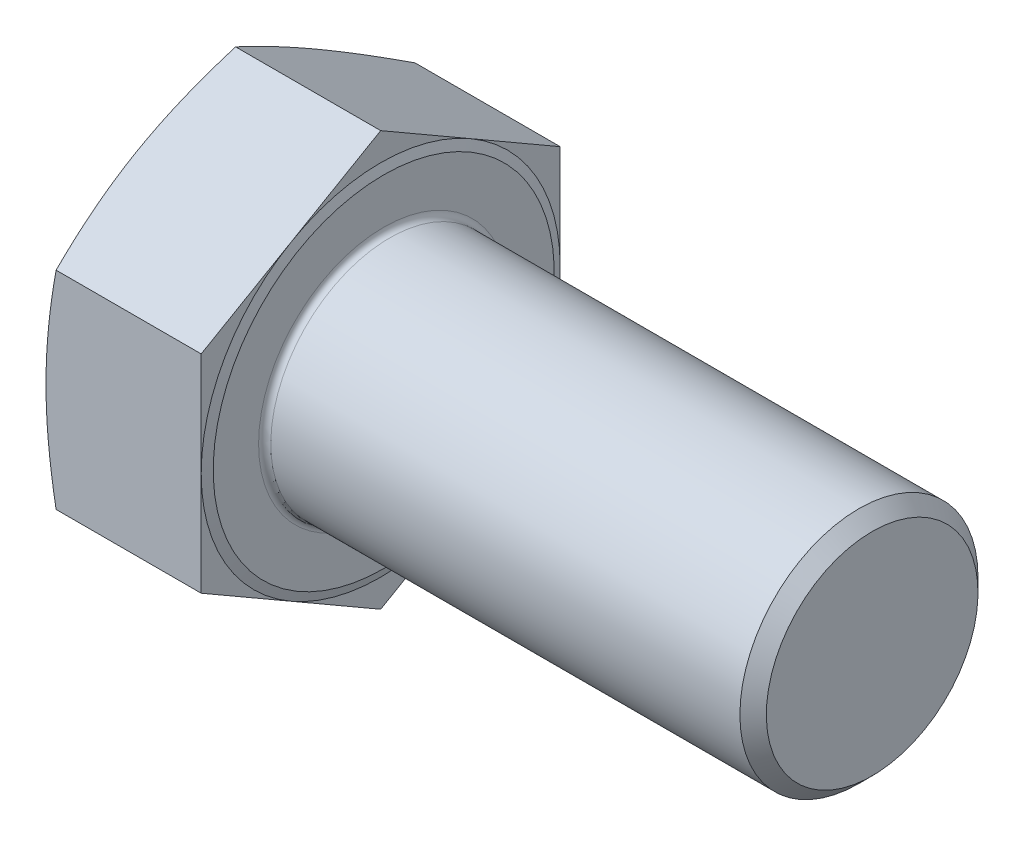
ISO-10303-21;
HEADER;
FILE_DESCRIPTION(('STEP AP214'),'2;1');
FILE_NAME('part.step','',(''),(''),'','','');
FILE_SCHEMA(('AUTOMOTIVE_DESIGN { 1 0 10303 214 1 1 1 1 }'));
ENDSEC;
DATA;
#1=APPLICATION_CONTEXT('core data for automotive mechanical design processes');
#2=APPLICATION_PROTOCOL_DEFINITION('international standard','automotive_design',2000,#1);
#3=PRODUCT_CONTEXT('',#1,'mechanical');
#4=PRODUCT('Part','Part','',(#3));
#5=PRODUCT_RELATED_PRODUCT_CATEGORY('part','',(#4));
#6=PRODUCT_DEFINITION_FORMATION('','',#4);
#7=PRODUCT_DEFINITION_CONTEXT('part definition',#1,'design');
#8=PRODUCT_DEFINITION('design','',#6,#7);
#9=PRODUCT_DEFINITION_SHAPE('','',#8);
#10=(LENGTH_UNIT() NAMED_UNIT(*) SI_UNIT(.MILLI.,.METRE.));
#11=(NAMED_UNIT(*) PLANE_ANGLE_UNIT() SI_UNIT($,.RADIAN.));
#12=(NAMED_UNIT(*) SI_UNIT($,.STERADIAN.) SOLID_ANGLE_UNIT());
#13=UNCERTAINTY_MEASURE_WITH_UNIT(LENGTH_MEASURE(1.E-05),#10,'distance_accuracy_value','');
#14=(GEOMETRIC_REPRESENTATION_CONTEXT(3) GLOBAL_UNCERTAINTY_ASSIGNED_CONTEXT((#13)) GLOBAL_UNIT_ASSIGNED_CONTEXT((#10,
#11,#12)) REPRESENTATION_CONTEXT('',''));
#15=CARTESIAN_POINT('',(0.,0.,0.));
#16=DIRECTION('',(0.,0.,1.));
#17=DIRECTION('',(1.,0.,0.));
#18=AXIS2_PLACEMENT_3D('',#15,#16,#17);
#19=CARTESIAN_POINT('',(25.92,0.,0.));
#20=DIRECTION('',(-1.,0.,0.));
#21=DIRECTION('',(0.,-1.,0.));
#22=AXIS2_PLACEMENT_3D('',#19,#20,#21);
#23=PLANE('',#22);
#24=CARTESIAN_POINT('',(25.92,0.,0.));
#25=DIRECTION('',(-1.,0.,0.));
#26=DIRECTION('',(0.,-1.,0.));
#27=AXIS2_PLACEMENT_3D('',#24,#25,#26);
#28=CIRCLE('',#27,20.5);
#29=CARTESIAN_POINT('',(25.92,-20.5,0.));
#30=VERTEX_POINT('',#29);
#31=EDGE_CURVE('E11',#30,#30,#28,.T.);
#32=ORIENTED_EDGE('',*,*,#31,.T.);
#33=EDGE_LOOP('',(#32));
#34=FACE_BOUND('',#33,.T.);
#35=CARTESIAN_POINT('',(25.92,0.,0.));
#36=DIRECTION('',(-1.,0.,0.));
#37=DIRECTION('',(0.,-1.,0.));
#38=AXIS2_PLACEMENT_3D('',#35,#36,#37);
#39=CIRCLE('',#38,27.93);
#40=CARTESIAN_POINT('',(25.92,-27.93,0.));
#41=VERTEX_POINT('',#40);
#42=EDGE_CURVE('E140',#41,#41,#39,.T.);
#43=ORIENTED_EDGE('',*,*,#42,.F.);
#44=EDGE_LOOP('',(#43));
#45=FACE_BOUND('',#44,.T.);
#46=ADVANCED_FACE('F32',(#34,#45),#23,.F.);
#47=CARTESIAN_POINT('',(25.42,0.,58.8));
#48=DIRECTION('',(-1.,0.,0.));
#49=DIRECTION('',(0.,0.,1.));
#50=AXIS2_PLACEMENT_3D('',#47,#48,#49);
#51=PLANE('',#50);
#52=DIRECTION('',(0.,-0.5,-0.866025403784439));
#53=VECTOR('',#52,1.);
#54=CARTESIAN_POINT('',(25.42,-16.974097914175,29.4));
#55=LINE('',#54,#53);
#56=CARTESIAN_POINT('',(25.42,-16.974097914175,29.4));
#57=VERTEX_POINT('',#56);
#58=CARTESIAN_POINT('',(25.42,-25.4611468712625,14.7));
#59=VERTEX_POINT('',#58);
#60=EDGE_CURVE('E139',#57,#59,#55,.T.);
#61=ORIENTED_EDGE('',*,*,#60,.T.);
#62=CARTESIAN_POINT('',(25.42,0.,0.));
#63=DIRECTION('',(-1.,0.,0.));
#64=DIRECTION('',(0.,-1.,0.));
#65=AXIS2_PLACEMENT_3D('',#62,#63,#64);
#66=CIRCLE('',#65,29.4);
#67=CARTESIAN_POINT('',(25.42,0.,29.4));
#68=VERTEX_POINT('',#67);
#69=EDGE_CURVE('E48',#59,#68,#66,.T.);
#70=ORIENTED_EDGE('',*,*,#69,.T.);
#71=DIRECTION('',(0.,-1.,0.));
#72=VECTOR('',#71,1.);
#73=CARTESIAN_POINT('',(25.42,16.974097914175,29.4));
#74=LINE('',#73,#72);
#75=EDGE_CURVE('E136',#68,#57,#74,.T.);
#76=ORIENTED_EDGE('',*,*,#75,.T.);
#77=EDGE_LOOP('',(#61,#70,#76));
#78=FACE_BOUND('',#77,.T.);
#79=ADVANCED_FACE('F135',(#78),#51,.F.);
#80=CARTESIAN_POINT('',(25.42,16.974097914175,29.4));
#81=VERTEX_POINT('',#80);
#82=EDGE_CURVE('E147',#81,#68,#74,.T.);
#83=ORIENTED_EDGE('',*,*,#82,.T.);
#84=CARTESIAN_POINT('',(25.42,25.4611468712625,14.7));
#85=VERTEX_POINT('',#84);
#86=EDGE_CURVE('E122',#68,#85,#66,.T.);
#87=ORIENTED_EDGE('',*,*,#86,.T.);
#88=DIRECTION('',(0.,-0.5,0.866025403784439));
#89=VECTOR('',#88,1.);
#90=CARTESIAN_POINT('',(25.42,33.94819582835,0.));
#91=LINE('',#90,#89);
#92=EDGE_CURVE('E153',#85,#81,#91,.T.);
#93=ORIENTED_EDGE('',*,*,#92,.T.);
#94=EDGE_LOOP('',(#83,#87,#93));
#95=FACE_BOUND('',#94,.T.);
#96=ADVANCED_FACE('F152',(#95),#51,.F.);
#97=CARTESIAN_POINT('',(25.42,33.94819582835,0.));
#98=VERTEX_POINT('',#97);
#99=EDGE_CURVE('E150',#98,#85,#91,.T.);
#100=ORIENTED_EDGE('',*,*,#99,.T.);
#101=CARTESIAN_POINT('',(25.42,25.4611468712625,-14.7));
#102=VERTEX_POINT('',#101);
#103=EDGE_CURVE('E126',#85,#102,#66,.T.);
#104=ORIENTED_EDGE('',*,*,#103,.T.);
#105=DIRECTION('',(0.,0.5,0.866025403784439));
#106=VECTOR('',#105,1.);
#107=CARTESIAN_POINT('',(25.42,16.974097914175,-29.4));
#108=LINE('',#107,#106);
#109=EDGE_CURVE('E309',#102,#98,#108,.T.);
#110=ORIENTED_EDGE('',*,*,#109,.T.);
#111=EDGE_LOOP('',(#100,#104,#110));
#112=FACE_BOUND('',#111,.T.);
#113=ADVANCED_FACE('F298',(#112),#51,.F.);
#114=CARTESIAN_POINT('',(25.42,16.974097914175,-29.4));
#115=VERTEX_POINT('',#114);
#116=EDGE_CURVE('E312',#115,#102,#108,.T.);
#117=ORIENTED_EDGE('',*,*,#116,.T.);
#118=CARTESIAN_POINT('',(25.42,0.,-29.4));
#119=VERTEX_POINT('',#118);
#120=EDGE_CURVE('E371',#102,#119,#66,.T.);
#121=ORIENTED_EDGE('',*,*,#120,.T.);
#122=DIRECTION('',(0.,1.,0.));
#123=VECTOR('',#122,1.);
#124=CARTESIAN_POINT('',(25.42,-16.974097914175,-29.4));
#125=LINE('',#124,#123);
#126=EDGE_CURVE('E310',#119,#115,#125,.T.);
#127=ORIENTED_EDGE('',*,*,#126,.T.);
#128=EDGE_LOOP('',(#117,#121,#127));
#129=FACE_BOUND('',#128,.T.);
#130=ADVANCED_FACE('F291',(#129),#51,.F.);
#131=CARTESIAN_POINT('',(25.42,-16.974097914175,-29.4));
#132=VERTEX_POINT('',#131);
#133=EDGE_CURVE('E303',#132,#119,#125,.T.);
#134=ORIENTED_EDGE('',*,*,#133,.T.);
#135=CARTESIAN_POINT('',(25.42,-25.4611468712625,-14.7));
#136=VERTEX_POINT('',#135);
#137=EDGE_CURVE('E304',#119,#136,#66,.T.);
#138=ORIENTED_EDGE('',*,*,#137,.T.);
#139=DIRECTION('',(0.,0.5,-0.866025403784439));
#140=VECTOR('',#139,1.);
#141=CARTESIAN_POINT('',(25.42,-33.94819582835,0.));
#142=LINE('',#141,#140);
#143=EDGE_CURVE('E306',#136,#132,#142,.T.);
#144=ORIENTED_EDGE('',*,*,#143,.T.);
#145=EDGE_LOOP('',(#134,#138,#144));
#146=FACE_BOUND('',#145,.T.);
#147=ADVANCED_FACE('F283',(#146),#51,.F.);
#148=CARTESIAN_POINT('',(25.42,-16.974097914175,29.4));
#149=DIRECTION('',(0.,0.866025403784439,-0.5));
#150=DIRECTION('',(0.,0.5,0.866025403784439));
#151=AXIS2_PLACEMENT_3D('',#148,#149,#150);
#152=PLANE('',#151);
#153=CARTESIAN_POINT('',(1.65544992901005,-33.9483112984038,-0.000199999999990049));
#154=CARTESIAN_POINT('',(1.5275139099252,-33.5968031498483,0.608629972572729));
#155=CARTESIAN_POINT('',(1.40533534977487,-33.2447587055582,1.21838883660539));
#156=CARTESIAN_POINT('',(1.17375096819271,-32.5395886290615,2.43977923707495));
#157=CARTESIAN_POINT('',(1.06434636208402,-32.1864628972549,3.0514109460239));
#158=CARTESIAN_POINT('',(0.859514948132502,-31.478920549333,4.27691024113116));
#159=CARTESIAN_POINT('',(0.764098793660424,-31.1245031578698,4.89077917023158));
#160=CARTESIAN_POINT('',(0.588608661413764,-30.4147218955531,6.12015637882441));
#161=CARTESIAN_POINT('',(0.508534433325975,-30.0593580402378,6.73566463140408));
#162=CARTESIAN_POINT('',(0.365585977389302,-29.3511492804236,7.96231818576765));
#163=CARTESIAN_POINT('',(0.302556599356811,-28.9983122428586,8.57344986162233));
#164=CARTESIAN_POINT('',(0.193711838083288,-28.2919695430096,9.79687130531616));
#165=CARTESIAN_POINT('',(0.147896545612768,-27.9384638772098,10.4091610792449));
#166=CARTESIAN_POINT('',(0.0742768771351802,-27.2311108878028,11.6343323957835));
#167=CARTESIAN_POINT('',(0.0464659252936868,-26.8772637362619,12.2472136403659));
#168=CARTESIAN_POINT('',(0.00932751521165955,-26.1693266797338,13.4733965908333));
#169=CARTESIAN_POINT('',(0.,-25.8152367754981,14.0866982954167));
#170=CARTESIAN_POINT('',(0.,-25.1070569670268,15.3133017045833));
#171=CARTESIAN_POINT('',(0.0093275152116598,-24.7529670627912,15.9266034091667));
#172=CARTESIAN_POINT('',(0.0464659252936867,-24.0450300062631,17.1527863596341));
#173=CARTESIAN_POINT('',(0.0742768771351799,-23.6911828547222,17.7656676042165));
#174=CARTESIAN_POINT('',(0.147896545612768,-22.9838298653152,18.9908389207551));
#175=CARTESIAN_POINT('',(0.193711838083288,-22.6303241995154,19.6031286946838));
#176=CARTESIAN_POINT('',(0.302556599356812,-21.9239814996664,20.8265501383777));
#177=CARTESIAN_POINT('',(0.365585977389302,-21.5711444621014,21.4376818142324));
#178=CARTESIAN_POINT('',(0.508534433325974,-20.8629357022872,22.6643353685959));
#179=CARTESIAN_POINT('',(0.588608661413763,-20.5075718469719,23.2798436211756));
#180=CARTESIAN_POINT('',(0.764098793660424,-19.7977905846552,24.5092208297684));
#181=CARTESIAN_POINT('',(0.859514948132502,-19.4433731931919,25.1230897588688));
#182=CARTESIAN_POINT('',(1.06434636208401,-18.7358308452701,26.3485890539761));
#183=CARTESIAN_POINT('',(1.1737509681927,-18.3827051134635,26.9602207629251));
#184=CARTESIAN_POINT('',(1.40533534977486,-17.6775350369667,28.1816111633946));
#185=CARTESIAN_POINT('',(1.5275139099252,-17.3254905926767,28.7913700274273));
#186=CARTESIAN_POINT('',(1.65544992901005,-16.9739824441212,29.4002));
#187=B_SPLINE_CURVE_WITH_KNOTS('',3,(#153,#154,#155,#156,#157,#158,#159,#160,#161,#162,#163,
#164,#165,#166,#167,#168,#169,#170,#171,#172,#173,#174,#175,#176,#177,#178,#179,#180,#181,#182,
#183,#184,#185,#186),.UNSPECIFIED.,.F.,.F.,(4,2,2,2,2,2,2,2,2,2,2,2,2,2,2,2,4),(0.,
2.14369982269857,4.28760343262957,6.433131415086,8.57862438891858,10.7038751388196,
12.8291370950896,14.9536223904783,17.0781011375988,19.2025798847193,21.3270651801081,
23.4523271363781,25.5775778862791,27.7230708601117,29.8685988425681,32.0125024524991,
34.1562022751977),.UNSPECIFIED.);
#188=CARTESIAN_POINT('',(1.65540790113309,-33.94819582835,0.));
#189=VERTEX_POINT('',#188);
#190=CARTESIAN_POINT('',(0.,-25.4611468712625,14.7));
#191=VERTEX_POINT('',#190);
#192=EDGE_CURVE('E352',#189,#191,#187,.T.);
#193=ORIENTED_EDGE('',*,*,#192,.F.);
#194=DIRECTION('',(-1.,0.,0.));
#195=VECTOR('',#194,1.);
#196=CARTESIAN_POINT('',(25.42,-33.94819582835,0.));
#197=LINE('',#196,#195);
#198=CARTESIAN_POINT('',(25.42,-33.94819582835,0.));
#199=VERTEX_POINT('',#198);
#200=EDGE_CURVE('E170',#199,#189,#197,.T.);
#201=ORIENTED_EDGE('',*,*,#200,.F.);
#202=EDGE_CURVE('E360',#59,#199,#55,.T.);
#203=ORIENTED_EDGE('',*,*,#202,.F.);
#204=ORIENTED_EDGE('',*,*,#60,.F.);
#205=DIRECTION('',(-1.,0.,0.));
#206=VECTOR('',#205,1.);
#207=CARTESIAN_POINT('',(25.42,-16.974097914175,29.4));
#208=LINE('',#207,#206);
#209=CARTESIAN_POINT('',(1.65540790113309,-16.974097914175,29.4));
#210=VERTEX_POINT('',#209);
#211=EDGE_CURVE('E149',#57,#210,#208,.T.);
#212=ORIENTED_EDGE('',*,*,#211,.T.);
#213=EDGE_CURVE('E240',#191,#210,#187,.T.);
#214=ORIENTED_EDGE('',*,*,#213,.F.);
#215=EDGE_LOOP('',(#193,#201,#203,#204,#212,#214));
#216=FACE_BOUND('',#215,.T.);
#217=ADVANCED_FACE('F34',(#216),#152,.F.);
#218=CARTESIAN_POINT('',(25.42,-33.94819582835,0.));
#219=DIRECTION('',(0.,0.866025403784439,0.5));
#220=DIRECTION('',(0.,-0.5,0.866025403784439));
#221=AXIS2_PLACEMENT_3D('',#218,#219,#220);
#222=PLANE('',#221);
#223=CARTESIAN_POINT('',(1.65544992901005,-16.9739824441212,-29.4002));
#224=CARTESIAN_POINT('',(1.5275139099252,-17.3254905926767,-28.7913700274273));
#225=CARTESIAN_POINT('',(1.40533534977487,-17.6775350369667,-28.1816111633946));
#226=CARTESIAN_POINT('',(1.17375096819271,-18.3827051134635,-26.9602207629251));
#227=CARTESIAN_POINT('',(1.06434636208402,-18.7358308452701,-26.3485890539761));
#228=CARTESIAN_POINT('',(0.859514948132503,-19.4433731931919,-25.1230897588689));
#229=CARTESIAN_POINT('',(0.764098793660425,-19.7977905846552,-24.5092208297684));
#230=CARTESIAN_POINT('',(0.588608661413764,-20.5075718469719,-23.2798436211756));
#231=CARTESIAN_POINT('',(0.508534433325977,-20.8629357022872,-22.6643353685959));
#232=CARTESIAN_POINT('',(0.365585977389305,-21.5711444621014,-21.4376818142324));
#233=CARTESIAN_POINT('',(0.302556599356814,-21.9239814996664,-20.8265501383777));
#234=CARTESIAN_POINT('',(0.19371183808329,-22.6303241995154,-19.6031286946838));
#235=CARTESIAN_POINT('',(0.147896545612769,-22.9838298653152,-18.9908389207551));
#236=CARTESIAN_POINT('',(0.0742768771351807,-23.6911828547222,-17.7656676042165));
#237=CARTESIAN_POINT('',(0.0464659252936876,-24.0450300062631,-17.1527863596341));
#238=CARTESIAN_POINT('',(0.00932751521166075,-24.7529670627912,-15.9266034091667));
#239=CARTESIAN_POINT('',(0.,-25.1070569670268,-15.3133017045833));
#240=CARTESIAN_POINT('',(0.,-25.8152367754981,-14.0866982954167));
#241=CARTESIAN_POINT('',(0.00932751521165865,-26.1693266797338,-13.4733965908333));
#242=CARTESIAN_POINT('',(0.0464659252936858,-26.8772637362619,-12.2472136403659));
#243=CARTESIAN_POINT('',(0.0742768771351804,-27.2311108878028,-11.6343323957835));
#244=CARTESIAN_POINT('',(0.147896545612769,-27.9384638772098,-10.4091610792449));
#245=CARTESIAN_POINT('',(0.193711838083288,-28.2919695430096,-9.79687130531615));
#246=CARTESIAN_POINT('',(0.302556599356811,-28.9983122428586,-8.57344986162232));
#247=CARTESIAN_POINT('',(0.365585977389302,-29.3511492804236,-7.96231818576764));
#248=CARTESIAN_POINT('',(0.508534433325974,-30.0593580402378,-6.73566463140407));
#249=CARTESIAN_POINT('',(0.588608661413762,-30.4147218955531,-6.1201563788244));
#250=CARTESIAN_POINT('',(0.764098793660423,-31.1245031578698,-4.89077917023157));
#251=CARTESIAN_POINT('',(0.859514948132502,-31.478920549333,-4.27691024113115));
#252=CARTESIAN_POINT('',(1.06434636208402,-32.1864628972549,-3.05141094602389));
#253=CARTESIAN_POINT('',(1.1737509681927,-32.5395886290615,-2.43977923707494));
#254=CARTESIAN_POINT('',(1.40533534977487,-33.2447587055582,-1.21838883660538));
#255=CARTESIAN_POINT('',(1.5275139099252,-33.5968031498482,-0.608629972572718));
#256=CARTESIAN_POINT('',(1.65544992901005,-33.9483112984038,0.000200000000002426));
#257=B_SPLINE_CURVE_WITH_KNOTS('',3,(#223,#224,#225,#226,#227,#228,#229,#230,#231,#232,#233,
#234,#235,#236,#237,#238,#239,#240,#241,#242,#243,#244,#245,#246,#247,#248,#249,#250,#251,#252,
#253,#254,#255,#256),.UNSPECIFIED.,.F.,.F.,(4,2,2,2,2,2,2,2,2,2,2,2,2,2,2,2,4),(0.,
2.14369982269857,4.28760343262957,6.43313141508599,8.57862438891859,10.7038751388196,
12.8291370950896,14.9536223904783,17.0781011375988,19.2025798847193,21.3270651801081,
23.4523271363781,25.5775778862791,27.7230708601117,29.8685988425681,32.0125024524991,
34.1562022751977),.UNSPECIFIED.);
#258=CARTESIAN_POINT('',(1.65540790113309,-16.974097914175,-29.4));
#259=VERTEX_POINT('',#258);
#260=CARTESIAN_POINT('',(0.,-25.4611468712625,-14.7));
#261=VERTEX_POINT('',#260);
#262=EDGE_CURVE('E255',#259,#261,#257,.T.);
#263=ORIENTED_EDGE('',*,*,#262,.F.);
#264=DIRECTION('',(-1.,0.,0.));
#265=VECTOR('',#264,1.);
#266=CARTESIAN_POINT('',(25.42,-16.974097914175,-29.4));
#267=LINE('',#266,#265);
#268=EDGE_CURVE('E167',#132,#259,#267,.T.);
#269=ORIENTED_EDGE('',*,*,#268,.F.);
#270=ORIENTED_EDGE('',*,*,#143,.F.);
#271=EDGE_CURVE('E313',#199,#136,#142,.T.);
#272=ORIENTED_EDGE('',*,*,#271,.F.);
#273=ORIENTED_EDGE('',*,*,#200,.T.);
#274=EDGE_CURVE('E251',#261,#189,#257,.T.);
#275=ORIENTED_EDGE('',*,*,#274,.F.);
#276=EDGE_LOOP('',(#263,#269,#270,#272,#273,#275));
#277=FACE_BOUND('',#276,.T.);
#278=ADVANCED_FACE('F262',(#277),#222,.F.);
#279=CARTESIAN_POINT('',(25.42,-16.974097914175,-29.4));
#280=DIRECTION('',(0.,0.,1.));
#281=DIRECTION('',(0.,-1.,0.));
#282=AXIS2_PLACEMENT_3D('',#279,#280,#281);
#283=PLANE('',#282);
#284=CARTESIAN_POINT('',(8.8458449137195,-44.9414479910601,-29.4));
#285=CARTESIAN_POINT('',(8.64327840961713,-44.2763764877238,-29.4));
#286=CARTESIAN_POINT('',(8.4419369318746,-43.6109320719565,-29.4));
#287=CARTESIAN_POINT('',(8.04197827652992,-42.2792210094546,-29.4));
#288=CARTESIAN_POINT('',(7.84336111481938,-41.6129543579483,-29.4));
#289=CARTESIAN_POINT('',(7.25198186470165,-39.6127195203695,-29.4));
#290=CARTESIAN_POINT('',(6.86372203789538,-38.2774147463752,-29.4));
#291=CARTESIAN_POINT('',(6.10126336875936,-35.6000928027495,-29.4));
#292=CARTESIAN_POINT('',(5.7270921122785,-34.2580677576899,-29.4));
#293=CARTESIAN_POINT('',(4.9971590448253,-31.5690262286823,-29.4));
#294=CARTESIAN_POINT('',(4.64139690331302,-30.2220098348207,-29.4));
#295=CARTESIAN_POINT('',(3.95709637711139,-27.5387320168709,-29.4));
#296=CARTESIAN_POINT('',(3.62827641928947,-26.2025427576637,-29.4));
#297=CARTESIAN_POINT('',(2.99863098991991,-23.5235161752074,-29.4));
#298=CARTESIAN_POINT('',(2.69780598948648,-22.1806787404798,-29.4));
#299=CARTESIAN_POINT('',(2.13116522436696,-19.4880508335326,-29.4));
#300=CARTESIAN_POINT('',(1.86533751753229,-18.1382628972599,-29.4));
#301=CARTESIAN_POINT('',(1.37678298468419,-15.4308636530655,-29.4));
#302=CARTESIAN_POINT('',(1.15405471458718,-14.0732526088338,-29.4));
#303=CARTESIAN_POINT('',(0.782809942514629,-11.5030206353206,-29.4));
#304=CARTESIAN_POINT('',(0.628772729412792,-10.2912096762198,-29.4));
#305=CARTESIAN_POINT('',(0.433189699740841,-8.46971553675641,-29.4));
#306=CARTESIAN_POINT('',(0.373906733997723,-7.86191013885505,-29.4));
#307=CARTESIAN_POINT('',(0.267832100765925,-6.64521595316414,-29.4));
#308=CARTESIAN_POINT('',(0.22104011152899,-6.03632719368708,-29.4));
#309=CARTESIAN_POINT('',(0.140552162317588,-4.81810273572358,-29.4));
#310=CARTESIAN_POINT('',(0.106847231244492,-4.20876763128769,-29.4));
#311=CARTESIAN_POINT('',(0.0529231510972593,-2.98949852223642,-29.4));
#312=CARTESIAN_POINT('',(0.0327039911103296,-2.37956451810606,-29.4));
#313=CARTESIAN_POINT('',(0.00602332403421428,-1.1593967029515,-29.4));
#314=CARTESIAN_POINT('',(-0.000438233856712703,-0.54916289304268,-29.4));
#315=CARTESIAN_POINT('',(0.000484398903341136,0.671294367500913,-29.4));
#316=CARTESIAN_POINT('',(0.00786859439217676,1.281517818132,-29.4));
#317=CARTESIAN_POINT('',(0.0364542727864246,2.50473436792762,-29.4));
#318=CARTESIAN_POINT('',(0.0577255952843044,3.11772582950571,-29.4));
#319=CARTESIAN_POINT('',(0.113864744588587,4.34308303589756,-29.4));
#320=CARTESIAN_POINT('',(0.148732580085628,4.95544878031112,-29.4));
#321=CARTESIAN_POINT('',(0.231611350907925,6.1792893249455,-29.4));
#322=CARTESIAN_POINT('',(0.279622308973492,6.79076412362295,-29.4));
#323=CARTESIAN_POINT('',(0.388192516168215,8.01260431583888,-29.4));
#324=CARTESIAN_POINT('',(0.448752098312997,8.62296967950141,-29.4));
#325=CARTESIAN_POINT('',(0.648336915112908,10.4531228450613,-29.4));
#326=CARTESIAN_POINT('',(0.805200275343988,11.670994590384,-29.4));
#327=CARTESIAN_POINT('',(1.16016895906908,14.1006040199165,-29.4));
#328=CARTESIAN_POINT('',(1.35827450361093,15.3123416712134,-29.4));
#329=CARTESIAN_POINT('',(1.80067196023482,17.7934990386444,-29.4));
#330=CARTESIAN_POINT('',(2.0468526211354,19.0625795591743,-29.4));
#331=CARTESIAN_POINT('',(2.57089937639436,21.5942203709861,-29.4));
#332=CARTESIAN_POINT('',(2.84876785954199,22.8567801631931,-29.4));
#333=CARTESIAN_POINT('',(3.43035498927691,25.3762832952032,-29.4));
#334=CARTESIAN_POINT('',(3.73408114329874,26.6332248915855,-29.4));
#335=CARTESIAN_POINT('',(4.36244304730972,29.1418129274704,-29.4));
#336=CARTESIAN_POINT('',(4.6870782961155,30.3934594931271,-29.4));
#337=CARTESIAN_POINT('',(5.35377779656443,32.8938074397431,-29.4));
#338=CARTESIAN_POINT('',(5.69586389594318,34.1425029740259,-29.4));
#339=CARTESIAN_POINT('',(6.39395180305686,36.6359928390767,-29.4));
#340=CARTESIAN_POINT('',(6.74995366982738,37.8807871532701,-29.4));
#341=CARTESIAN_POINT('',(7.47332607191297,40.3668343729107,-29.4));
#342=CARTESIAN_POINT('',(7.84069468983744,41.6080878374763,-29.4));
#343=CARTESIAN_POINT('',(8.58488250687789,44.087750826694,-29.4));
#344=CARTESIAN_POINT('',(8.96170168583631,45.326160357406,-29.4));
#345=CARTESIAN_POINT('',(9.71901271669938,47.7868927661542,-29.4));
#346=CARTESIAN_POINT('',(10.0994180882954,49.0092422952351,-29.4));
#347=CARTESIAN_POINT('',(10.8667087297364,51.451903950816,-29.4));
#348=CARTESIAN_POINT('',(11.2535940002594,52.6722160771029,-29.4));
#349=CARTESIAN_POINT('',(12.0328712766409,55.1111409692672,-29.4));
#350=CARTESIAN_POINT('',(12.4252635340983,56.3297536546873,-29.4));
#351=CARTESIAN_POINT('',(13.2147302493,58.7654616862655,-29.4));
#352=CARTESIAN_POINT('',(13.6118047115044,59.9825570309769,-29.4));
#353=CARTESIAN_POINT('',(14.4084575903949,62.410811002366,-29.4));
#354=CARTESIAN_POINT('',(14.8080207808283,63.6219746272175,-29.4));
#355=CARTESIAN_POINT('',(15.610595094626,66.0431592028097,-29.4));
#356=CARTESIAN_POINT('',(16.013606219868,67.2531801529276,-29.4));
#357=CARTESIAN_POINT('',(16.8225888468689,69.6721214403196,-29.4));
#358=CARTESIAN_POINT('',(17.2285601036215,70.8810418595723,-29.4));
#359=CARTESIAN_POINT('',(18.0431295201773,73.2979942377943,-29.4));
#360=CARTESIAN_POINT('',(18.4517276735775,74.5060261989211,-29.4));
#361=CARTESIAN_POINT('',(18.8614572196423,75.7136733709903,-29.4));
#362=B_SPLINE_CURVE_WITH_KNOTS('',3,(#284,#285,#286,#287,#288,#289,#290,#291,#292,#293,#294,
#295,#296,#297,#298,#299,#300,#301,#302,#303,#304,#305,#306,#307,#308,#309,#310,#311,#312,#313,
#314,#315,#316,#317,#318,#319,#320,#321,#322,#323,#324,#325,#326,#327,#328,#329,#330,#331,#332,
#333,#334,#335,#336,#337,#338,#339,#340,#341,#342,#343,#344,#345,#346,#347,#348,#349,#350,#351,
#352,#353,#354,#355,#356,#357,#358,#359,#360,#361),.UNSPECIFIED.,.F.,.F.,(4,2,2,2,2,2,2,2,2,2,2,
2,2,2,2,2,2,2,2,2,2,2,2,2,2,2,2,2,2,2,2,2,2,2,2,2,2,2,4),(0.,2.0857062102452,4.17142458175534,
8.34316965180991,12.5226981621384,16.7021516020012,20.8300745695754,24.9580669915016,
29.0846471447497,33.2110890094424,36.8748774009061,38.7068381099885,40.5387516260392,
42.3694071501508,44.2000611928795,46.0307084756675,47.8613563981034,49.7012824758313,
51.5412097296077,53.3811401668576,55.2211194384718,58.9040023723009,62.5869050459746,
66.4646143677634,70.342616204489,74.2217478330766,78.1007865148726,81.9848068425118,
85.8688436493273,89.7522288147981,93.6356056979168,97.4761079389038,101.316610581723,
105.157289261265,108.997971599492,112.824075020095,116.650180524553,120.475972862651,
124.301755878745),.UNSPECIFIED.);
#363=CARTESIAN_POINT('',(1.65540790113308,16.974097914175,-29.4));
#364=VERTEX_POINT('',#363);
#365=CARTESIAN_POINT('',(0.,0.,-29.4));
#366=VERTEX_POINT('',#365);
#367=EDGE_CURVE('E361',#364,#366,#362,.F.);
#368=ORIENTED_EDGE('',*,*,#367,.F.);
#369=DIRECTION('',(-1.,0.,0.));
#370=VECTOR('',#369,1.);
#371=CARTESIAN_POINT('',(25.42,16.974097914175,-29.4));
#372=LINE('',#371,#370);
#373=EDGE_CURVE('E164',#115,#364,#372,.T.);
#374=ORIENTED_EDGE('',*,*,#373,.F.);
#375=ORIENTED_EDGE('',*,*,#126,.F.);
#376=ORIENTED_EDGE('',*,*,#133,.F.);
#377=ORIENTED_EDGE('',*,*,#268,.T.);
#378=EDGE_CURVE('E256',#366,#259,#362,.F.);
#379=ORIENTED_EDGE('',*,*,#378,.F.);
#380=EDGE_LOOP('',(#368,#374,#375,#376,#377,#379));
#381=FACE_BOUND('',#380,.T.);
#382=ADVANCED_FACE('F265',(#381),#283,.F.);
#383=CARTESIAN_POINT('',(25.42,16.974097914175,-29.4));
#384=DIRECTION('',(0.,-0.866025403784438,0.5));
#385=DIRECTION('',(0.,-0.5,-0.866025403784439));
#386=AXIS2_PLACEMENT_3D('',#383,#384,#385);
#387=PLANE('',#386);
#388=CARTESIAN_POINT('',(1.65544992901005,33.9483112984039,0.000199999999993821));
#389=CARTESIAN_POINT('',(1.5275139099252,33.5968031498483,-0.608629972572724));
#390=CARTESIAN_POINT('',(1.40533534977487,33.2447587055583,-1.21838883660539));
#391=CARTESIAN_POINT('',(1.1737509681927,32.5395886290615,-2.43977923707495));
#392=CARTESIAN_POINT('',(1.06434636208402,32.186462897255,-3.0514109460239));
#393=CARTESIAN_POINT('',(0.859514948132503,31.4789205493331,-4.27691024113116));
#394=CARTESIAN_POINT('',(0.764098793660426,31.1245031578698,-4.89077917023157));
#395=CARTESIAN_POINT('',(0.588608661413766,30.4147218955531,-6.12015637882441));
#396=CARTESIAN_POINT('',(0.508534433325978,30.0593580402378,-6.73566463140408));
#397=CARTESIAN_POINT('',(0.365585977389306,29.3511492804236,-7.96231818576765));
#398=CARTESIAN_POINT('',(0.302556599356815,28.9983122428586,-8.57344986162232));
#399=CARTESIAN_POINT('',(0.193711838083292,28.2919695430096,-9.79687130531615));
#400=CARTESIAN_POINT('',(0.147896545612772,27.9384638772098,-10.4091610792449));
#401=CARTESIAN_POINT('',(0.0742768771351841,27.2311108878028,-11.6343323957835));
#402=CARTESIAN_POINT('',(0.04646592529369,26.8772637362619,-12.2472136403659));
#403=CARTESIAN_POINT('',(0.00932751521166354,26.1693266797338,-13.4733965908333));
#404=CARTESIAN_POINT('',(0.,25.8152367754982,-14.0866982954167));
#405=CARTESIAN_POINT('',(0.,25.1070569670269,-15.3133017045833));
#406=CARTESIAN_POINT('',(0.0093275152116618,24.7529670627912,-15.9266034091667));
#407=CARTESIAN_POINT('',(0.046465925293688,24.0450300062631,-17.1527863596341));
#408=CARTESIAN_POINT('',(0.0742768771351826,23.6911828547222,-17.7656676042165));
#409=CARTESIAN_POINT('',(0.147896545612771,22.9838298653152,-18.9908389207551));
#410=CARTESIAN_POINT('',(0.19371183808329,22.6303241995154,-19.6031286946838));
#411=CARTESIAN_POINT('',(0.302556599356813,21.9239814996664,-20.8265501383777));
#412=CARTESIAN_POINT('',(0.365585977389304,21.5711444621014,-21.4376818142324));
#413=CARTESIAN_POINT('',(0.508534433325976,20.8629357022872,-22.6643353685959));
#414=CARTESIAN_POINT('',(0.588608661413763,20.5075718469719,-23.2798436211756));
#415=CARTESIAN_POINT('',(0.764098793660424,19.7977905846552,-24.5092208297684));
#416=CARTESIAN_POINT('',(0.859514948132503,19.443373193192,-25.1230897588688));
#417=CARTESIAN_POINT('',(1.06434636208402,18.7358308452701,-26.3485890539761));
#418=CARTESIAN_POINT('',(1.17375096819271,18.3827051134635,-26.9602207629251));
#419=CARTESIAN_POINT('',(1.40533534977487,17.6775350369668,-28.1816111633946));
#420=CARTESIAN_POINT('',(1.5275139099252,17.3254905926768,-28.7913700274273));
#421=CARTESIAN_POINT('',(1.65544992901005,16.9739824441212,-29.4002));
#422=B_SPLINE_CURVE_WITH_KNOTS('',3,(#388,#389,#390,#391,#392,#393,#394,#395,#396,#397,#398,
#399,#400,#401,#402,#403,#404,#405,#406,#407,#408,#409,#410,#411,#412,#413,#414,#415,#416,#417,
#418,#419,#420,#421),.UNSPECIFIED.,.F.,.F.,(4,2,2,2,2,2,2,2,2,2,2,2,2,2,2,2,4),(0.,
2.14369982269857,4.28760343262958,6.43313141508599,8.57862438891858,10.7038751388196,
12.8291370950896,14.9536223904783,17.0781011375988,19.2025798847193,21.3270651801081,
23.4523271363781,25.5775778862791,27.7230708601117,29.8685988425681,32.0125024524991,
34.1562022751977),.UNSPECIFIED.);
#423=CARTESIAN_POINT('',(1.65540790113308,33.94819582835,0.));
#424=VERTEX_POINT('',#423);
#425=CARTESIAN_POINT('',(0.,25.4611468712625,-14.7));
#426=VERTEX_POINT('',#425);
#427=EDGE_CURVE('E245',#424,#426,#422,.T.);
#428=ORIENTED_EDGE('',*,*,#427,.F.);
#429=DIRECTION('',(-1.,0.,0.));
#430=VECTOR('',#429,1.);
#431=CARTESIAN_POINT('',(25.42,33.94819582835,0.));
#432=LINE('',#431,#430);
#433=EDGE_CURVE('E161',#98,#424,#432,.T.);
#434=ORIENTED_EDGE('',*,*,#433,.F.);
#435=ORIENTED_EDGE('',*,*,#109,.F.);
#436=ORIENTED_EDGE('',*,*,#116,.F.);
#437=ORIENTED_EDGE('',*,*,#373,.T.);
#438=EDGE_CURVE('E353',#426,#364,#422,.T.);
#439=ORIENTED_EDGE('',*,*,#438,.F.);
#440=EDGE_LOOP('',(#428,#434,#435,#436,#437,#439));
#441=FACE_BOUND('',#440,.T.);
#442=ADVANCED_FACE('F269',(#441),#387,.F.);
#443=CARTESIAN_POINT('',(25.42,33.94819582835,0.));
#444=DIRECTION('',(0.,-0.866025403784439,-0.5));
#445=DIRECTION('',(0.,0.5,-0.866025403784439));
#446=AXIS2_PLACEMENT_3D('',#443,#444,#445);
#447=PLANE('',#446);
#448=CARTESIAN_POINT('',(1.65544992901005,16.9739824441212,29.4002));
#449=CARTESIAN_POINT('',(1.5275139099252,17.3254905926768,28.7913700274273));
#450=CARTESIAN_POINT('',(1.40533534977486,17.6775350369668,28.1816111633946));
#451=CARTESIAN_POINT('',(1.1737509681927,18.3827051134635,26.9602207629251));
#452=CARTESIAN_POINT('',(1.06434636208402,18.7358308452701,26.3485890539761));
#453=CARTESIAN_POINT('',(0.859514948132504,19.443373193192,25.1230897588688));
#454=CARTESIAN_POINT('',(0.764098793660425,19.7977905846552,24.5092208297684));
#455=CARTESIAN_POINT('',(0.588608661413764,20.5075718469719,23.2798436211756));
#456=CARTESIAN_POINT('',(0.508534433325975,20.8629357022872,22.6643353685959));
#457=CARTESIAN_POINT('',(0.365585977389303,21.5711444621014,21.4376818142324));
#458=CARTESIAN_POINT('',(0.302556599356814,21.9239814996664,20.8265501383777));
#459=CARTESIAN_POINT('',(0.193711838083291,22.6303241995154,19.6031286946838));
#460=CARTESIAN_POINT('',(0.147896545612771,22.9838298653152,18.9908389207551));
#461=CARTESIAN_POINT('',(0.0742768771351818,23.6911828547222,17.7656676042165));
#462=CARTESIAN_POINT('',(0.0464659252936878,24.0450300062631,17.1527863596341));
#463=CARTESIAN_POINT('',(0.00932751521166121,24.7529670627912,15.9266034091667));
#464=CARTESIAN_POINT('',(0.,25.1070569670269,15.3133017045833));
#465=CARTESIAN_POINT('',(0.,25.8152367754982,14.0866982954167));
#466=CARTESIAN_POINT('',(0.00932751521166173,26.1693266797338,13.4733965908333));
#467=CARTESIAN_POINT('',(0.0464659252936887,26.8772637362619,12.2472136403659));
#468=CARTESIAN_POINT('',(0.0742768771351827,27.2311108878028,11.6343323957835));
#469=CARTESIAN_POINT('',(0.147896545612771,27.9384638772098,10.4091610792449));
#470=CARTESIAN_POINT('',(0.193711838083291,28.2919695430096,9.79687130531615));
#471=CARTESIAN_POINT('',(0.302556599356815,28.9983122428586,8.57344986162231));
#472=CARTESIAN_POINT('',(0.365585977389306,29.3511492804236,7.96231818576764));
#473=CARTESIAN_POINT('',(0.508534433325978,30.0593580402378,6.73566463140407));
#474=CARTESIAN_POINT('',(0.588608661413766,30.4147218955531,6.1201563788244));
#475=CARTESIAN_POINT('',(0.764098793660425,31.1245031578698,4.89077917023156));
#476=CARTESIAN_POINT('',(0.859514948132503,31.4789205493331,4.27691024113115));
#477=CARTESIAN_POINT('',(1.06434636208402,32.186462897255,3.05141094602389));
#478=CARTESIAN_POINT('',(1.1737509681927,32.5395886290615,2.43977923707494));
#479=CARTESIAN_POINT('',(1.40533534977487,33.2447587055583,1.21838883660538));
#480=CARTESIAN_POINT('',(1.5275139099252,33.5968031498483,0.608629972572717));
#481=CARTESIAN_POINT('',(1.65544992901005,33.9483112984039,-0.000200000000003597));
#482=B_SPLINE_CURVE_WITH_KNOTS('',3,(#448,#449,#450,#451,#452,#453,#454,#455,#456,#457,#458,
#459,#460,#461,#462,#463,#464,#465,#466,#467,#468,#469,#470,#471,#472,#473,#474,#475,#476,#477,
#478,#479,#480,#481),.UNSPECIFIED.,.F.,.F.,(4,2,2,2,2,2,2,2,2,2,2,2,2,2,2,2,4),(0.,
2.14369982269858,4.28760343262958,6.433131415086,8.57862438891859,10.7038751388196,
12.8291370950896,14.9536223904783,17.0781011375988,19.2025798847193,21.3270651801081,
23.4523271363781,25.5775778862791,27.7230708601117,29.8685988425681,32.0125024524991,
34.1562022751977),.UNSPECIFIED.);
#483=CARTESIAN_POINT('',(1.65540790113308,16.974097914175,29.4));
#484=VERTEX_POINT('',#483);
#485=CARTESIAN_POINT('',(0.,25.4611468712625,14.7));
#486=VERTEX_POINT('',#485);
#487=EDGE_CURVE('E233',#484,#486,#482,.T.);
#488=ORIENTED_EDGE('',*,*,#487,.F.);
#489=DIRECTION('',(-1.,0.,0.));
#490=VECTOR('',#489,1.);
#491=CARTESIAN_POINT('',(25.42,16.974097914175,29.4));
#492=LINE('',#491,#490);
#493=EDGE_CURVE('E155',#81,#484,#492,.T.);
#494=ORIENTED_EDGE('',*,*,#493,.F.);
#495=ORIENTED_EDGE('',*,*,#92,.F.);
#496=ORIENTED_EDGE('',*,*,#99,.F.);
#497=ORIENTED_EDGE('',*,*,#433,.T.);
#498=EDGE_CURVE('E345',#486,#424,#482,.T.);
#499=ORIENTED_EDGE('',*,*,#498,.F.);
#500=EDGE_LOOP('',(#488,#494,#495,#496,#497,#499));
#501=FACE_BOUND('',#500,.T.);
#502=ADVANCED_FACE('F273',(#501),#447,.F.);
#503=CARTESIAN_POINT('',(25.42,16.974097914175,29.4));
#504=DIRECTION('',(0.,0.,-1.));
#505=DIRECTION('',(-1.,0.,0.));
#506=AXIS2_PLACEMENT_3D('',#503,#504,#505);
#507=PLANE('',#506);
#508=CARTESIAN_POINT('',(8.84584332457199,-44.941442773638,29.4));
#509=CARTESIAN_POINT('',(8.64327685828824,-44.2763713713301,29.4));
#510=CARTESIAN_POINT('',(8.44193541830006,-43.6109270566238,29.4));
#511=CARTESIAN_POINT('',(8.04197683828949,-42.2792161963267,29.4));
#512=CARTESIAN_POINT('',(7.84335971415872,-41.6129496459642,29.4));
#513=CARTESIAN_POINT('',(7.25198057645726,-39.612715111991,29.4));
#514=CARTESIAN_POINT('',(6.86372082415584,-38.2774105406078,29.4));
#515=CARTESIAN_POINT('',(6.10126230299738,-35.6000890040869,29.4));
#516=CARTESIAN_POINT('',(5.7270911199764,-34.258064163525,29.4));
#517=CARTESIAN_POINT('',(4.99715819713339,-31.5690230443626,29.4));
#518=CARTESIAN_POINT('',(4.64139612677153,-30.2220068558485,29.4));
#519=CARTESIAN_POINT('',(3.95709573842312,-27.5387294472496,29.4));
#520=CARTESIAN_POINT('',(3.62827584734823,-26.202540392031,29.4));
#521=CARTESIAN_POINT('',(2.99863054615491,-23.5235142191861,29.4));
#522=CARTESIAN_POINT('',(2.69780560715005,-22.1806769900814,29.4));
#523=CARTESIAN_POINT('',(2.1311649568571,-19.488049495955,29.4));
#524=CARTESIAN_POINT('',(1.86533730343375,-18.1382617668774,29.4));
#525=CARTESIAN_POINT('',(1.37678286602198,-15.4308629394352,29.4));
#526=CARTESIAN_POINT('',(1.15405463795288,-14.0732521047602,29.4));
#527=CARTESIAN_POINT('',(0.782809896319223,-11.5030202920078,29.4));
#528=CARTESIAN_POINT('',(0.628772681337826,-10.2912092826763,29.4));
#529=CARTESIAN_POINT('',(0.433189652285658,-8.4697150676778,29.4));
#530=CARTESIAN_POINT('',(0.373906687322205,-7.86190964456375,29.4));
#531=CARTESIAN_POINT('',(0.26783205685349,-6.64521540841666,29.4));
#532=CARTESIAN_POINT('',(0.221040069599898,-6.03632662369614,29.4));
#533=CARTESIAN_POINT('',(0.140552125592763,-4.81810211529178,29.4));
#534=CARTESIAN_POINT('',(0.106847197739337,-4.20876698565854,29.4));
#535=CARTESIAN_POINT('',(0.0529231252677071,-2.98949782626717,29.4));
#536=CARTESIAN_POINT('',(0.0327039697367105,-2.37956379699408,29.4));
#537=CARTESIAN_POINT('',(0.00602331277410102,-1.15939593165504,29.4));
#538=CARTESIAN_POINT('',(-0.000438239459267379,-0.549162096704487,29.4));
#539=CARTESIAN_POINT('',(0.000484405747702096,0.671295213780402,29.4));
#540=CARTESIAN_POINT('',(0.00786860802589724,1.28151868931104,29.4));
#541=CARTESIAN_POINT('',(0.0364543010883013,2.50473528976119,29.4));
#542=CARTESIAN_POINT('',(0.0577256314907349,3.11772677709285,29.4));
#543=CARTESIAN_POINT('',(0.113864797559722,4.34308403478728,29.4));
#544=CARTESIAN_POINT('',(0.148732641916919,4.95544980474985,29.4));
#545=CARTESIAN_POINT('',(0.231611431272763,6.17929040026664,29.4));
#546=CARTESIAN_POINT('',(0.279622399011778,6.7907652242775,29.4));
#547=CARTESIAN_POINT('',(0.388192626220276,8.01260546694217,29.4));
#548=CARTESIAN_POINT('',(0.448752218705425,8.62297085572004,29.4));
#549=CARTESIAN_POINT('',(0.648337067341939,10.4531240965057,29.4));
#550=CARTESIAN_POINT('',(0.805200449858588,11.670995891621,29.4));
#551=CARTESIAN_POINT('',(1.16016917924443,14.10060542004,29.4));
#552=CARTESIAN_POINT('',(1.35827474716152,15.3123431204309,29.4));
#553=CARTESIAN_POINT('',(1.80067224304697,17.7935005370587,29.4));
#554=CARTESIAN_POINT('',(2.04685291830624,19.0625810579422,29.4));
#555=CARTESIAN_POINT('',(2.57089969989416,21.5942218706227,29.4));
#556=CARTESIAN_POINT('',(2.84876819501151,22.856781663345,29.4));
#557=CARTESIAN_POINT('',(3.43035534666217,25.3762847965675,29.4));
#558=CARTESIAN_POINT('',(3.73408151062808,26.6332263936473,29.4));
#559=CARTESIAN_POINT('',(4.3624434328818,29.141814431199,29.4));
#560=CARTESIAN_POINT('',(4.68707868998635,30.393460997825,29.4));
#561=CARTESIAN_POINT('',(5.35377820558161,32.8938089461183,29.4));
#562=CARTESIAN_POINT('',(5.69586431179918,34.1425044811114,29.4));
#563=CARTESIAN_POINT('',(6.39395223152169,36.6359943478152,29.4));
#564=CARTESIAN_POINT('',(6.74995410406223,37.8807886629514,29.4));
#565=CARTESIAN_POINT('',(7.47332651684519,40.366835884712,29.4));
#566=CARTESIAN_POINT('',(7.84069513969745,41.6080893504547,29.4));
#567=CARTESIAN_POINT('',(8.58488296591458,44.0877523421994,29.4));
#568=CARTESIAN_POINT('',(8.9617021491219,45.3261618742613,29.4));
#569=CARTESIAN_POINT('',(9.71901318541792,47.786894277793,29.4));
#570=CARTESIAN_POINT('',(10.0994185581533,49.0092438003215,29.4));
#571=CARTESIAN_POINT('',(10.8667092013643,51.4519054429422,29.4));
#572=CARTESIAN_POINT('',(11.2535944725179,52.6722175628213,29.4));
#573=CARTESIAN_POINT('',(12.0328717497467,55.111142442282,29.4));
#574=CARTESIAN_POINT('',(12.4252640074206,56.3297551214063,29.4));
#575=CARTESIAN_POINT('',(13.2147307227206,58.7654631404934,29.4));
#576=CARTESIAN_POINT('',(13.6118051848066,59.9825584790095,29.4));
#577=CARTESIAN_POINT('',(14.4084580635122,62.4108124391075,29.4));
#578=CARTESIAN_POINT('',(14.8080212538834,63.6219760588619,29.4));
#579=CARTESIAN_POINT('',(15.6105955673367,66.0431606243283,29.4));
#580=CARTESIAN_POINT('',(16.0136066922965,67.2531815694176,29.4));
#581=CARTESIAN_POINT('',(16.8225893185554,69.6721228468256,29.4));
#582=CARTESIAN_POINT('',(17.2285605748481,70.8810432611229,29.4));
#583=CARTESIAN_POINT('',(18.0431299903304,73.2979956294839,29.4));
#584=CARTESIAN_POINT('',(18.4517281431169,74.5060275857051,29.4));
#585=CARTESIAN_POINT('',(18.8614576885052,75.7136747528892,29.4));
#586=B_SPLINE_CURVE_WITH_KNOTS('',3,(#508,#509,#510,#511,#512,#513,#514,#515,#516,#517,#518,
#519,#520,#521,#522,#523,#524,#525,#526,#527,#528,#529,#530,#531,#532,#533,#534,#535,#536,#537,
#538,#539,#540,#541,#542,#543,#544,#545,#546,#547,#548,#549,#550,#551,#552,#553,#554,#555,#556,
#557,#558,#559,#560,#561,#562,#563,#564,#565,#566,#567,#568,#569,#570,#571,#572,#573,#574,#575,
#576,#577,#578,#579,#580,#581,#582,#583,#584,#585),.UNSPECIFIED.,.F.,.F.,(4,2,2,2,2,2,2,2,2,2,2,
2,2,2,2,2,2,2,2,2,2,2,2,2,2,2,2,2,2,2,2,2,2,2,2,2,2,2,4),(0.,2.08570588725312,4.17142393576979,
8.34316835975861,12.5226962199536,16.7021490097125,20.8300713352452,24.9580631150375,
29.0846426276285,33.211083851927,36.8748723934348,38.7068331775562,40.5387467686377,
42.3694023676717,44.2000564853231,46.0307038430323,47.8613518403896,49.7012779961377,
51.5412053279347,53.3811358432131,55.221115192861,58.9039982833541,62.586901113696,
66.4646104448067,70.3426122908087,74.2217439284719,78.1007826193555,81.9848029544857,
85.8688397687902,89.7522249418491,93.6356018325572,97.4761040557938,101.316606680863,
105.157285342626,108.997967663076,112.824071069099,116.650176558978,120.475968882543,
124.301751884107),.UNSPECIFIED.);
#587=CARTESIAN_POINT('',(0.,0.,29.4));
#588=VERTEX_POINT('',#587);
#589=EDGE_CURVE('E326',#210,#588,#586,.T.);
#590=ORIENTED_EDGE('',*,*,#589,.F.);
#591=ORIENTED_EDGE('',*,*,#211,.F.);
#592=ORIENTED_EDGE('',*,*,#75,.F.);
#593=ORIENTED_EDGE('',*,*,#82,.F.);
#594=ORIENTED_EDGE('',*,*,#493,.T.);
#595=EDGE_CURVE('E223',#588,#484,#586,.T.);
#596=ORIENTED_EDGE('',*,*,#595,.F.);
#597=EDGE_LOOP('',(#590,#591,#592,#593,#594,#596));
#598=FACE_BOUND('',#597,.T.);
#599=ADVANCED_FACE('F145',(#598),#507,.F.);
#600=ORIENTED_EDGE('',*,*,#271,.T.);
#601=EDGE_CURVE('E141',#136,#59,#66,.T.);
#602=ORIENTED_EDGE('',*,*,#601,.T.);
#603=ORIENTED_EDGE('',*,*,#202,.T.);
#604=EDGE_LOOP('',(#600,#602,#603));
#605=FACE_BOUND('',#604,.T.);
#606=ADVANCED_FACE('F206',(#605),#51,.F.);
#607=CARTESIAN_POINT('',(0.,0.,0.));
#608=DIRECTION('',(1.,0.,0.));
#609=DIRECTION('',(0.,1.,0.));
#610=AXIS2_PLACEMENT_3D('',#607,#608,#609);
#611=CONICAL_SURFACE('',#610,29.4,1.22173047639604);
#612=ORIENTED_EDGE('',*,*,#213,.T.);
#613=ORIENTED_EDGE('',*,*,#589,.T.);
#614=CARTESIAN_POINT('',(0.,0.,0.));
#615=DIRECTION('',(-1.,0.,0.));
#616=DIRECTION('',(0.,-1.,0.));
#617=AXIS2_PLACEMENT_3D('',#614,#615,#616);
#618=CIRCLE('',#617,29.4);
#619=EDGE_CURVE('E56',#191,#588,#618,.T.);
#620=ORIENTED_EDGE('',*,*,#619,.F.);
#621=EDGE_LOOP('',(#612,#613,#620));
#622=FACE_BOUND('',#621,.T.);
#623=ADVANCED_FACE('F281',(#622),#611,.T.);
#624=ORIENTED_EDGE('',*,*,#274,.T.);
#625=ORIENTED_EDGE('',*,*,#192,.T.);
#626=CARTESIAN_POINT('',(0.,0.,0.));
#627=DIRECTION('',(-1.,0.,0.));
#628=DIRECTION('',(0.,0.,1.));
#629=AXIS2_PLACEMENT_3D('',#626,#627,#628);
#630=CIRCLE('',#629,29.4);
#631=EDGE_CURVE('E173',#261,#191,#630,.T.);
#632=ORIENTED_EDGE('',*,*,#631,.F.);
#633=EDGE_LOOP('',(#624,#625,#632));
#634=FACE_BOUND('',#633,.T.);
#635=ADVANCED_FACE('F287',(#634),#611,.T.);
#636=ORIENTED_EDGE('',*,*,#378,.T.);
#637=ORIENTED_EDGE('',*,*,#262,.T.);
#638=EDGE_CURVE('E369',#366,#261,#630,.T.);
#639=ORIENTED_EDGE('',*,*,#638,.F.);
#640=EDGE_LOOP('',(#636,#637,#639));
#641=FACE_BOUND('',#640,.T.);
#642=ADVANCED_FACE('F216',(#641),#611,.T.);
#643=ORIENTED_EDGE('',*,*,#367,.T.);
#644=EDGE_CURVE('E351',#426,#366,#630,.T.);
#645=ORIENTED_EDGE('',*,*,#644,.F.);
#646=ORIENTED_EDGE('',*,*,#438,.T.);
#647=EDGE_LOOP('',(#643,#645,#646));
#648=FACE_BOUND('',#647,.T.);
#649=ADVANCED_FACE('F211',(#648),#611,.T.);
#650=ORIENTED_EDGE('',*,*,#427,.T.);
#651=EDGE_CURVE('E176',#486,#426,#630,.T.);
#652=ORIENTED_EDGE('',*,*,#651,.F.);
#653=ORIENTED_EDGE('',*,*,#498,.T.);
#654=EDGE_LOOP('',(#650,#652,#653));
#655=FACE_BOUND('',#654,.T.);
#656=ADVANCED_FACE('F215',(#655),#611,.T.);
#657=ORIENTED_EDGE('',*,*,#487,.T.);
#658=EDGE_CURVE('E174',#588,#486,#630,.T.);
#659=ORIENTED_EDGE('',*,*,#658,.F.);
#660=ORIENTED_EDGE('',*,*,#595,.T.);
#661=EDGE_LOOP('',(#657,#659,#660));
#662=FACE_BOUND('',#661,.T.);
#663=ADVANCED_FACE('F218',(#662),#611,.T.);
#664=CARTESIAN_POINT('',(0.,0.,58.8));
#665=DIRECTION('',(-1.,0.,0.));
#666=DIRECTION('',(0.,0.,1.));
#667=AXIS2_PLACEMENT_3D('',#664,#665,#666);
#668=PLANE('',#667);
#669=ORIENTED_EDGE('',*,*,#619,.T.);
#670=ORIENTED_EDGE('',*,*,#658,.T.);
#671=ORIENTED_EDGE('',*,*,#651,.T.);
#672=ORIENTED_EDGE('',*,*,#644,.T.);
#673=ORIENTED_EDGE('',*,*,#638,.T.);
#674=ORIENTED_EDGE('',*,*,#631,.T.);
#675=EDGE_LOOP('',(#669,#670,#671,#672,#673,#674));
#676=FACE_BOUND('',#675,.T.);
#677=ADVANCED_FACE('F219',(#676),#668,.T.);
#678=CARTESIAN_POINT('',(25.92,0.,0.));
#679=DIRECTION('',(-1.,0.,0.));
#680=DIRECTION('',(0.,-1.,0.));
#681=AXIS2_PLACEMENT_3D('',#678,#679,#680);
#682=CONICAL_SURFACE('',#681,27.93,1.24293586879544);
#683=ORIENTED_EDGE('',*,*,#69,.F.);
#684=ORIENTED_EDGE('',*,*,#601,.F.);
#685=ORIENTED_EDGE('',*,*,#137,.F.);
#686=ORIENTED_EDGE('',*,*,#120,.F.);
#687=ORIENTED_EDGE('',*,*,#103,.F.);
#688=ORIENTED_EDGE('',*,*,#86,.F.);
#689=EDGE_LOOP('',(#683,#684,#685,#686,#687,#688));
#690=FACE_BOUND('',#689,.T.);
#691=ORIENTED_EDGE('',*,*,#42,.T.);
#692=EDGE_LOOP('',(#691));
#693=FACE_BOUND('',#692,.T.);
#694=ADVANCED_FACE('F123',(#690,#693),#682,.T.);
#695=CARTESIAN_POINT('',(105.92,0.,0.));
#696=DIRECTION('',(-1.,0.,0.));
#697=DIRECTION('',(0.,-1.,0.));
#698=AXIS2_PLACEMENT_3D('',#695,#696,#697);
#699=CYLINDRICAL_SURFACE('',#698,19.5);
#700=CARTESIAN_POINT('',(26.92,0.,0.));
#701=DIRECTION('',(-1.,0.,0.));
#702=DIRECTION('',(0.,-1.,0.));
#703=AXIS2_PLACEMENT_3D('',#700,#701,#702);
#704=CIRCLE('',#703,19.5);
#705=CARTESIAN_POINT('',(26.92,-19.5,0.));
#706=VERTEX_POINT('',#705);
#707=EDGE_CURVE('E41',#706,#706,#704,.F.);
#708=ORIENTED_EDGE('',*,*,#707,.T.);
#709=EDGE_LOOP('',(#708));
#710=FACE_BOUND('',#709,.T.);
#711=CARTESIAN_POINT('',(103.755,0.,0.));
#712=DIRECTION('',(1.,0.,0.));
#713=DIRECTION('',(0.,1.,0.));
#714=AXIS2_PLACEMENT_3D('',#711,#712,#713);
#715=CIRCLE('',#714,19.5);
#716=CARTESIAN_POINT('',(103.755,19.5,0.));
#717=VERTEX_POINT('',#716);
#718=EDGE_CURVE('E179',#717,#717,#715,.F.);
#719=ORIENTED_EDGE('',*,*,#718,.T.);
#720=EDGE_LOOP('',(#719));
#721=FACE_BOUND('',#720,.T.);
#722=ADVANCED_FACE('F184',(#710,#721),#699,.T.);
#723=CARTESIAN_POINT('',(105.92,0.,0.));
#724=DIRECTION('',(1.,0.,0.));
#725=DIRECTION('',(0.,1.,0.));
#726=AXIS2_PLACEMENT_3D('',#723,#724,#725);
#727=PLANE('',#726);
#728=CARTESIAN_POINT('',(105.92,0.,0.));
#729=DIRECTION('',(1.,0.,0.));
#730=DIRECTION('',(0.,1.,0.));
#731=AXIS2_PLACEMENT_3D('',#728,#729,#730);
#732=CIRCLE('',#731,17.335);
#733=CARTESIAN_POINT('',(105.92,17.335,0.));
#734=VERTEX_POINT('',#733);
#735=EDGE_CURVE('E130',#734,#734,#732,.T.);
#736=ORIENTED_EDGE('',*,*,#735,.T.);
#737=EDGE_LOOP('',(#736));
#738=FACE_BOUND('',#737,.T.);
#739=ADVANCED_FACE('F195',(#738),#727,.T.);
#740=CARTESIAN_POINT('',(105.92,0.,0.));
#741=DIRECTION('',(-1.,0.,0.));
#742=DIRECTION('',(0.,-1.,0.));
#743=AXIS2_PLACEMENT_3D('',#740,#741,#742);
#744=CONICAL_SURFACE('',#743,17.335,0.785398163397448);
#745=ORIENTED_EDGE('',*,*,#718,.F.);
#746=EDGE_LOOP('',(#745));
#747=FACE_BOUND('',#746,.T.);
#748=ORIENTED_EDGE('',*,*,#735,.F.);
#749=EDGE_LOOP('',(#748));
#750=FACE_BOUND('',#749,.T.);
#751=ADVANCED_FACE('F189',(#747,#750),#744,.T.);
#752=CARTESIAN_POINT('',(26.92,0.,0.));
#753=DIRECTION('',(-1.,0.,0.));
#754=DIRECTION('',(0.,-1.,0.));
#755=AXIS2_PLACEMENT_3D('',#752,#753,#754);
#756=TOROIDAL_SURFACE('',#755,20.5,1.);
#757=ORIENTED_EDGE('',*,*,#31,.F.);
#758=EDGE_LOOP('',(#757));
#759=FACE_BOUND('',#758,.T.);
#760=ORIENTED_EDGE('',*,*,#707,.F.);
#761=EDGE_LOOP('',(#760));
#762=FACE_BOUND('',#761,.T.);
#763=ADVANCED_FACE('F187',(#759,#762),#756,.F.);
#764=CLOSED_SHELL('',(#46,#79,#96,#113,#130,#147,#217,#278,#382,#442,#502,#599,#606,#623,#635,
#642,#649,#656,#663,#677,#694,#722,#739,#751,#763));
#765=MANIFOLD_SOLID_BREP('B2',#764);
#766=ADVANCED_BREP_SHAPE_REPRESENTATION('',(#18,#765),#14);
#767=SHAPE_DEFINITION_REPRESENTATION(#9,#766);
ENDSEC;
END-ISO-10303-21;
